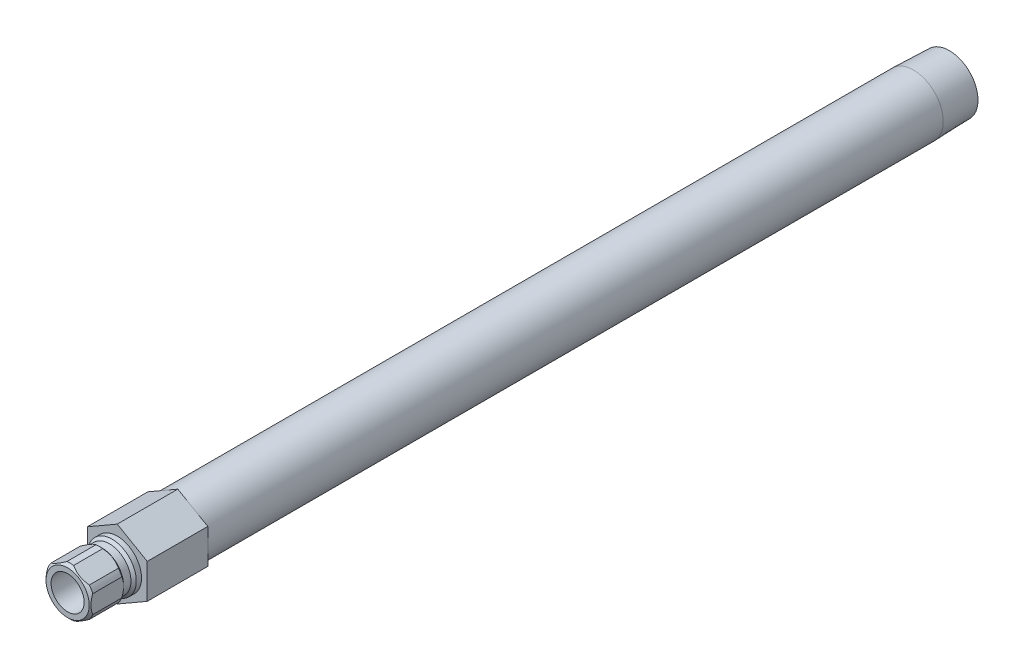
from build123d import *

# Parameters (mm, degrees)
SKETCH2_R           = 4.7625
BOSS_EXTRUDE1_DEPTH = 17.4498
CUT_EXTRUDE1_START  = 4.3942
SKETCH3_OUTSIDE_W   = 70.346
SKETCH3_OUTSIDE_H   = 73.018
CUT_EXTRUDE1_DEPTH  = 236.668323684


with BuildPart() as part:
    # Sketch1 → Revolve1 (revolve)
    with BuildSketch(Plane(origin=(0, 0, 0), x_dir=(0, 0, -1), z_dir=(1, 0, 0))):
        Polygon((-14.3002, 4.7625), (-14.3002, 6.223), (-13.5382, 6.985), (-5.1562, 6.985), (-4.3942, 6.223), (-2.27076, 6.223), (-1.50876, 6.985), (3.175, 6.985), (3.175, 8.5725), (229.362, 8.5725), (239.6998, 8.249445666), (239.6998, 6.2611), (17.4498, 6.2611), (17.4498, 4.7625), align=None)
    revolve(axis=Axis((0, 0, 0), (0, 0, 1)))

    # Sketch2 → Boss-Extrude1 (add)
    with BuildSketch(Plane.XY):
        Polygon((-8.636, 4.985996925), (-8.636, -4.985996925), (0, -9.971993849), (8.636, -4.985996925), (8.636, 4.985996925), (0, 9.971993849), align=None)
        with Locations(Location((0, 0, 0), (0, 0, 90))):
            Circle(SKETCH2_R, mode=Mode.SUBTRACT)
    extrude(amount=-BOSS_EXTRUDE1_DEPTH)

    # Sketch3 outside → Cut-Extrude1 (cut, through all)
    with BuildSketch(Plane.XY.offset(CUT_EXTRUDE1_START)):
        Rectangle(SKETCH3_OUTSIDE_W, SKETCH3_OUTSIDE_H)
        Polygon((6.477, -3.739497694), (6.477, 3.739497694), (0, 7.478995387), (-6.477, 3.739497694), (-6.477, -3.739497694), (0, -7.478995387), align=None, mode=Mode.SUBTRACT)
    extrude(amount=CUT_EXTRUDE1_DEPTH, mode=Mode.SUBTRACT)


solid = part.part
